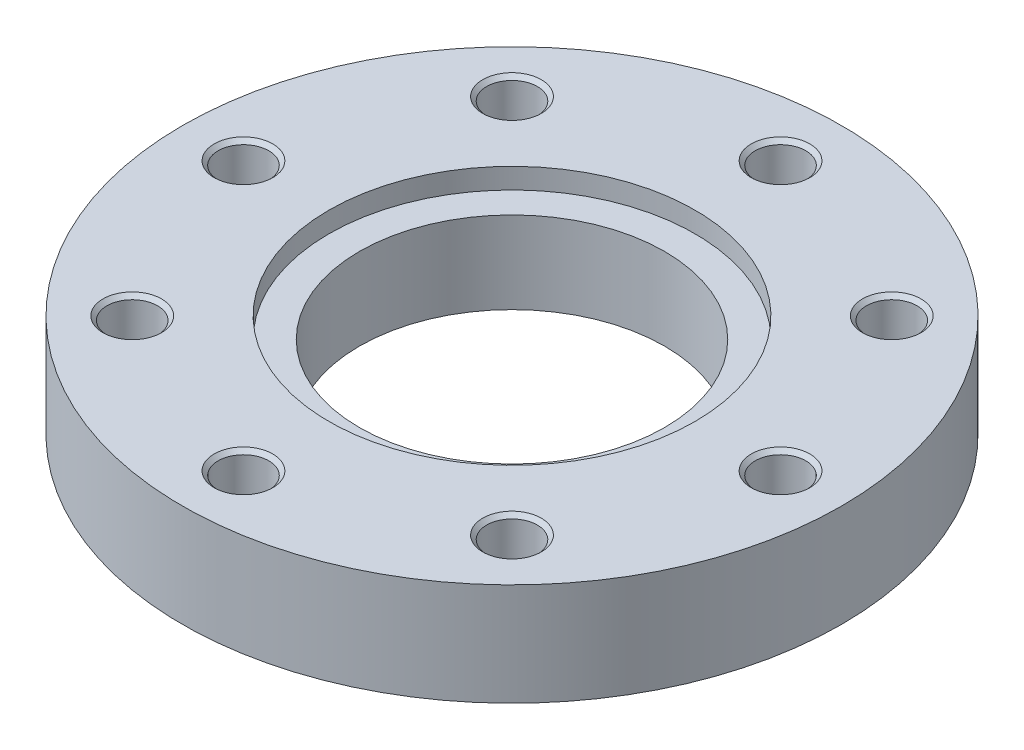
ISO-10303-21;
HEADER;
FILE_DESCRIPTION(('STEP AP214'),'2;1');
FILE_NAME('part.step','',(''),(''),'','','');
FILE_SCHEMA(('AUTOMOTIVE_DESIGN { 1 0 10303 214 1 1 1 1 }'));
ENDSEC;
DATA;
#1=APPLICATION_CONTEXT('core data for automotive mechanical design processes');
#2=APPLICATION_PROTOCOL_DEFINITION('international standard','automotive_design',2000,#1);
#3=PRODUCT_CONTEXT('',#1,'mechanical');
#4=PRODUCT('Part','Part','',(#3));
#5=PRODUCT_RELATED_PRODUCT_CATEGORY('part','',(#4));
#6=PRODUCT_DEFINITION_FORMATION('','',#4);
#7=PRODUCT_DEFINITION_CONTEXT('part definition',#1,'design');
#8=PRODUCT_DEFINITION('design','',#6,#7);
#9=PRODUCT_DEFINITION_SHAPE('','',#8);
#10=(LENGTH_UNIT() NAMED_UNIT(*) SI_UNIT(.MILLI.,.METRE.));
#11=(NAMED_UNIT(*) PLANE_ANGLE_UNIT() SI_UNIT($,.RADIAN.));
#12=(NAMED_UNIT(*) SI_UNIT($,.STERADIAN.) SOLID_ANGLE_UNIT());
#13=UNCERTAINTY_MEASURE_WITH_UNIT(LENGTH_MEASURE(1.E-05),#10,'distance_accuracy_value','');
#14=(GEOMETRIC_REPRESENTATION_CONTEXT(3) GLOBAL_UNCERTAINTY_ASSIGNED_CONTEXT((#13)) GLOBAL_UNIT_ASSIGNED_CONTEXT((#10,
#11,#12)) REPRESENTATION_CONTEXT('',''));
#15=CARTESIAN_POINT('',(0.,0.,0.));
#16=DIRECTION('',(0.,0.,1.));
#17=DIRECTION('',(1.,0.,0.));
#18=AXIS2_PLACEMENT_3D('',#15,#16,#17);
#19=CARTESIAN_POINT('',(0.,21.,0.));
#20=DIRECTION('',(0.,-1.,0.));
#21=DIRECTION('',(1.,0.,0.));
#22=AXIS2_PLACEMENT_3D('',#19,#20,#21);
#23=CYLINDRICAL_SURFACE('',#22,135.);
#24=CARTESIAN_POINT('',(0.,0.,0.));
#25=DIRECTION('',(0.,1.,0.));
#26=DIRECTION('',(1.,0.,0.));
#27=AXIS2_PLACEMENT_3D('',#24,#25,#26);
#28=CIRCLE('',#27,135.);
#29=CARTESIAN_POINT('',(135.,0.,0.));
#30=VERTEX_POINT('',#29);
#31=EDGE_CURVE('E9',#30,#30,#28,.T.);
#32=ORIENTED_EDGE('',*,*,#31,.T.);
#33=EDGE_LOOP('',(#32));
#34=FACE_BOUND('',#33,.T.);
#35=CARTESIAN_POINT('',(0.,42.,0.));
#36=DIRECTION('',(0.,1.,0.));
#37=DIRECTION('',(1.,0.,0.));
#38=AXIS2_PLACEMENT_3D('',#35,#36,#37);
#39=CIRCLE('',#38,135.);
#40=CARTESIAN_POINT('',(135.,42.,0.));
#41=VERTEX_POINT('',#40);
#42=EDGE_CURVE('E261',#41,#41,#39,.T.);
#43=ORIENTED_EDGE('',*,*,#42,.F.);
#44=EDGE_LOOP('',(#43));
#45=FACE_BOUND('',#44,.T.);
#46=ADVANCED_FACE('F15',(#34,#45),#23,.T.);
#47=CARTESIAN_POINT('',(98.75,0.,0.));
#48=DIRECTION('',(0.,-1.,0.));
#49=DIRECTION('',(-1.,0.,0.));
#50=AXIS2_PLACEMENT_3D('',#47,#48,#49);
#51=PLANE('',#50);
#52=CARTESIAN_POINT('',(0.,0.,0.));
#53=DIRECTION('',(0.,1.,0.));
#54=DIRECTION('',(1.,0.,0.));
#55=AXIS2_PLACEMENT_3D('',#52,#53,#54);
#56=CIRCLE('',#55,62.5);
#57=CARTESIAN_POINT('',(62.5,0.,0.));
#58=VERTEX_POINT('',#57);
#59=EDGE_CURVE('E22',#58,#58,#56,.T.);
#60=ORIENTED_EDGE('',*,*,#59,.T.);
#61=EDGE_LOOP('',(#60));
#62=FACE_BOUND('',#61,.T.);
#63=ORIENTED_EDGE('',*,*,#31,.F.);
#64=EDGE_LOOP('',(#63));
#65=FACE_BOUND('',#64,.T.);
#66=ADVANCED_FACE('F339',(#62,#65),#51,.T.);
#67=CARTESIAN_POINT('',(0.,21.,0.));
#68=DIRECTION('',(0.,-1.,0.));
#69=DIRECTION('',(1.,0.,0.));
#70=AXIS2_PLACEMENT_3D('',#67,#68,#69);
#71=CYLINDRICAL_SURFACE('',#70,62.5);
#72=ORIENTED_EDGE('',*,*,#59,.F.);
#73=EDGE_LOOP('',(#72));
#74=FACE_BOUND('',#73,.T.);
#75=CARTESIAN_POINT('',(0.,33.6,0.));
#76=DIRECTION('',(0.,1.,0.));
#77=DIRECTION('',(1.,0.,0.));
#78=AXIS2_PLACEMENT_3D('',#75,#76,#77);
#79=CIRCLE('',#78,62.5);
#80=CARTESIAN_POINT('',(-62.5,33.6,0.));
#81=VERTEX_POINT('',#80);
#82=EDGE_CURVE('E263',#81,#81,#79,.T.);
#83=ORIENTED_EDGE('',*,*,#82,.T.);
#84=EDGE_LOOP('',(#83));
#85=FACE_BOUND('',#84,.T.);
#86=ADVANCED_FACE('F320',(#74,#85),#71,.F.);
#87=CARTESIAN_POINT('',(98.75,42.,0.));
#88=DIRECTION('',(0.,1.,0.));
#89=DIRECTION('',(1.,0.,0.));
#90=AXIS2_PLACEMENT_3D('',#87,#88,#89);
#91=PLANE('',#90);
#92=ORIENTED_EDGE('',*,*,#42,.T.);
#93=EDGE_LOOP('',(#92));
#94=FACE_BOUND('',#93,.T.);
#95=CARTESIAN_POINT('',(0.,42.,0.));
#96=DIRECTION('',(0.,-1.,0.));
#97=DIRECTION('',(1.,0.,0.));
#98=AXIS2_PLACEMENT_3D('',#95,#96,#97);
#99=CIRCLE('',#98,75.);
#100=CARTESIAN_POINT('',(-75.,42.,0.));
#101=VERTEX_POINT('',#100);
#102=EDGE_CURVE('E269',#101,#101,#99,.T.);
#103=ORIENTED_EDGE('',*,*,#102,.T.);
#104=EDGE_LOOP('',(#103));
#105=FACE_BOUND('',#104,.T.);
#106=CARTESIAN_POINT('',(110.,42.,0.));
#107=DIRECTION('',(0.,-1.,0.));
#108=DIRECTION('',(1.,0.,0.));
#109=AXIS2_PLACEMENT_3D('',#106,#107,#108);
#110=CIRCLE('',#109,12.);
#111=CARTESIAN_POINT('',(122.,42.,0.));
#112=VERTEX_POINT('',#111);
#113=EDGE_CURVE('E309',#112,#112,#110,.T.);
#114=ORIENTED_EDGE('',*,*,#113,.T.);
#115=EDGE_LOOP('',(#114));
#116=FACE_BOUND('',#115,.T.);
#117=CARTESIAN_POINT('',(77.7817459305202,42.,-77.7817459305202));
#118=DIRECTION('',(0.,-1.,0.));
#119=DIRECTION('',(0.707106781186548,0.,-0.707106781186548));
#120=AXIS2_PLACEMENT_3D('',#117,#118,#119);
#121=CIRCLE('',#120,12.);
#122=CARTESIAN_POINT('',(86.2670273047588,42.,-86.2670273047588));
#123=VERTEX_POINT('',#122);
#124=EDGE_CURVE('E227',#123,#123,#121,.T.);
#125=ORIENTED_EDGE('',*,*,#124,.T.);
#126=EDGE_LOOP('',(#125));
#127=FACE_BOUND('',#126,.T.);
#128=CARTESIAN_POINT('',(0.,42.,-110.));
#129=DIRECTION('',(0.,-1.,0.));
#130=DIRECTION('',(0.,0.,-1.));
#131=AXIS2_PLACEMENT_3D('',#128,#129,#130);
#132=CIRCLE('',#131,12.);
#133=CARTESIAN_POINT('',(0.,42.,-122.));
#134=VERTEX_POINT('',#133);
#135=EDGE_CURVE('E291',#134,#134,#132,.T.);
#136=ORIENTED_EDGE('',*,*,#135,.T.);
#137=EDGE_LOOP('',(#136));
#138=FACE_BOUND('',#137,.T.);
#139=CARTESIAN_POINT('',(-77.7817459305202,42.,-77.7817459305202));
#140=DIRECTION('',(0.,-1.,0.));
#141=DIRECTION('',(-0.707106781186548,0.,-0.707106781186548));
#142=AXIS2_PLACEMENT_3D('',#139,#140,#141);
#143=CIRCLE('',#142,12.);
#144=CARTESIAN_POINT('',(-86.2670273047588,42.,-86.2670273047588));
#145=VERTEX_POINT('',#144);
#146=EDGE_CURVE('E283',#145,#145,#143,.T.);
#147=ORIENTED_EDGE('',*,*,#146,.T.);
#148=EDGE_LOOP('',(#147));
#149=FACE_BOUND('',#148,.T.);
#150=CARTESIAN_POINT('',(-110.,42.,0.));
#151=DIRECTION('',(0.,-1.,0.));
#152=DIRECTION('',(-1.,0.,0.));
#153=AXIS2_PLACEMENT_3D('',#150,#151,#152);
#154=CIRCLE('',#153,12.);
#155=CARTESIAN_POINT('',(-122.,42.,0.));
#156=VERTEX_POINT('',#155);
#157=EDGE_CURVE('E274',#156,#156,#154,.T.);
#158=ORIENTED_EDGE('',*,*,#157,.T.);
#159=EDGE_LOOP('',(#158));
#160=FACE_BOUND('',#159,.T.);
#161=CARTESIAN_POINT('',(-77.7817459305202,42.,77.7817459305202));
#162=DIRECTION('',(0.,-1.,0.));
#163=DIRECTION('',(-0.707106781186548,0.,0.707106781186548));
#164=AXIS2_PLACEMENT_3D('',#161,#162,#163);
#165=CIRCLE('',#164,12.);
#166=CARTESIAN_POINT('',(-86.2670273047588,42.,86.2670273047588));
#167=VERTEX_POINT('',#166);
#168=EDGE_CURVE('E236',#167,#167,#165,.T.);
#169=ORIENTED_EDGE('',*,*,#168,.T.);
#170=EDGE_LOOP('',(#169));
#171=FACE_BOUND('',#170,.T.);
#172=CARTESIAN_POINT('',(0.,42.,110.));
#173=DIRECTION('',(0.,-1.,0.));
#174=DIRECTION('',(0.,0.,1.));
#175=AXIS2_PLACEMENT_3D('',#172,#173,#174);
#176=CIRCLE('',#175,12.);
#177=CARTESIAN_POINT('',(0.,42.,122.));
#178=VERTEX_POINT('',#177);
#179=EDGE_CURVE('E211',#178,#178,#176,.T.);
#180=ORIENTED_EDGE('',*,*,#179,.T.);
#181=EDGE_LOOP('',(#180));
#182=FACE_BOUND('',#181,.T.);
#183=CARTESIAN_POINT('',(77.7817459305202,42.,77.7817459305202));
#184=DIRECTION('',(0.,-1.,0.));
#185=DIRECTION('',(0.707106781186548,0.,0.707106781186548));
#186=AXIS2_PLACEMENT_3D('',#183,#184,#185);
#187=CIRCLE('',#186,12.);
#188=CARTESIAN_POINT('',(86.2670273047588,42.,86.2670273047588));
#189=VERTEX_POINT('',#188);
#190=EDGE_CURVE('E233',#189,#189,#187,.T.);
#191=ORIENTED_EDGE('',*,*,#190,.T.);
#192=EDGE_LOOP('',(#191));
#193=FACE_BOUND('',#192,.T.);
#194=ADVANCED_FACE('F212',(#94,#105,#116,#127,#138,#149,#160,#171,#182,#193),#91,.T.);
#195=CARTESIAN_POINT('',(0.,33.6,0.));
#196=DIRECTION('',(0.,-1.,0.));
#197=DIRECTION('',(-1.,0.,0.));
#198=AXIS2_PLACEMENT_3D('',#195,#196,#197);
#199=PLANE('',#198);
#200=CARTESIAN_POINT('',(0.,33.6,0.));
#201=DIRECTION('',(0.,-1.,0.));
#202=DIRECTION('',(1.,0.,0.));
#203=AXIS2_PLACEMENT_3D('',#200,#201,#202);
#204=CIRCLE('',#203,75.);
#205=CARTESIAN_POINT('',(75.,33.6,0.));
#206=VERTEX_POINT('',#205);
#207=EDGE_CURVE('E271',#206,#206,#204,.T.);
#208=ORIENTED_EDGE('',*,*,#207,.F.);
#209=EDGE_LOOP('',(#208));
#210=FACE_BOUND('',#209,.T.);
#211=ORIENTED_EDGE('',*,*,#82,.F.);
#212=EDGE_LOOP('',(#211));
#213=FACE_BOUND('',#212,.T.);
#214=ADVANCED_FACE('F322',(#210,#213),#199,.F.);
#215=CARTESIAN_POINT('',(0.,39.9,0.));
#216=DIRECTION('',(0.,-1.,0.));
#217=DIRECTION('',(1.,0.,0.));
#218=AXIS2_PLACEMENT_3D('',#215,#216,#217);
#219=CYLINDRICAL_SURFACE('',#218,75.);
#220=ORIENTED_EDGE('',*,*,#207,.T.);
#221=EDGE_LOOP('',(#220));
#222=FACE_BOUND('',#221,.T.);
#223=ORIENTED_EDGE('',*,*,#102,.F.);
#224=EDGE_LOOP('',(#223));
#225=FACE_BOUND('',#224,.T.);
#226=ADVANCED_FACE('F324',(#222,#225),#219,.F.);
#227=CARTESIAN_POINT('',(110.,6.00463463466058,0.));
#228=DIRECTION('',(0.,1.,0.));
#229=DIRECTION('',(1.,0.,0.));
#230=AXIS2_PLACEMENT_3D('',#227,#228,#229);
#231=CONICAL_SURFACE('',#230,5.188125,1.0471975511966);
#232=CARTESIAN_POINT('',(110.,9.,0.));
#233=DIRECTION('',(0.,-1.,0.));
#234=DIRECTION('',(1.,0.,0.));
#235=AXIS2_PLACEMENT_3D('',#232,#233,#234);
#236=CIRCLE('',#235,10.37625);
#237=CARTESIAN_POINT('',(120.37625,9.,0.));
#238=VERTEX_POINT('',#237);
#239=EDGE_CURVE('E272',#238,#238,#236,.T.);
#240=ORIENTED_EDGE('',*,*,#239,.F.);
#241=EDGE_LOOP('',(#240));
#242=FACE_BOUND('',#241,.T.);
#243=CARTESIAN_POINT('',(110.,3.00926926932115,0.));
#244=VERTEX_POINT('',#243);
#245=VERTEX_LOOP('',#244);
#246=FACE_BOUND('',#245,.T.);
#247=ADVANCED_FACE('F332',(#242,#246),#231,.F.);
#248=CARTESIAN_POINT('',(110.,12.688125,0.));
#249=DIRECTION('',(0.,1.,0.));
#250=DIRECTION('',(1.,0.,0.));
#251=AXIS2_PLACEMENT_3D('',#248,#249,#250);
#252=CYLINDRICAL_SURFACE('',#251,10.37625);
#253=CARTESIAN_POINT('',(110.,16.37625,0.));
#254=DIRECTION('',(0.,-1.,0.));
#255=DIRECTION('',(1.,0.,0.));
#256=AXIS2_PLACEMENT_3D('',#253,#254,#255);
#257=CIRCLE('',#256,10.37625);
#258=CARTESIAN_POINT('',(120.37625,16.37625,0.));
#259=VERTEX_POINT('',#258);
#260=EDGE_CURVE('E315',#259,#259,#257,.T.);
#261=ORIENTED_EDGE('',*,*,#260,.F.);
#262=EDGE_LOOP('',(#261));
#263=FACE_BOUND('',#262,.T.);
#264=ORIENTED_EDGE('',*,*,#239,.T.);
#265=EDGE_LOOP('',(#264));
#266=FACE_BOUND('',#265,.T.);
#267=ADVANCED_FACE('F505',(#263,#266),#252,.F.);
#268=CARTESIAN_POINT('',(110.,17.188125,0.));
#269=DIRECTION('',(0.,1.,0.));
#270=DIRECTION('',(1.,0.,0.));
#271=AXIS2_PLACEMENT_3D('',#268,#269,#270);
#272=CONICAL_SURFACE('',#271,11.188125,0.785398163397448);
#273=CARTESIAN_POINT('',(110.,18.,0.));
#274=DIRECTION('',(0.,-1.,0.));
#275=DIRECTION('',(1.,0.,0.));
#276=AXIS2_PLACEMENT_3D('',#273,#274,#275);
#277=CIRCLE('',#276,12.);
#278=CARTESIAN_POINT('',(122.,18.,0.));
#279=VERTEX_POINT('',#278);
#280=EDGE_CURVE('E313',#279,#279,#277,.T.);
#281=ORIENTED_EDGE('',*,*,#280,.F.);
#282=EDGE_LOOP('',(#281));
#283=FACE_BOUND('',#282,.T.);
#284=ORIENTED_EDGE('',*,*,#260,.T.);
#285=EDGE_LOOP('',(#284));
#286=FACE_BOUND('',#285,.T.);
#287=ADVANCED_FACE('F501',(#283,#286),#272,.F.);
#288=CARTESIAN_POINT('',(121.188125,18.,0.));
#289=DIRECTION('',(0.,1.,0.));
#290=DIRECTION('',(-1.,0.,0.));
#291=AXIS2_PLACEMENT_3D('',#288,#289,#290);
#292=PLANE('',#291);
#293=CARTESIAN_POINT('',(110.,18.,0.));
#294=DIRECTION('',(0.,-1.,0.));
#295=DIRECTION('',(1.,0.,0.));
#296=AXIS2_PLACEMENT_3D('',#293,#294,#295);
#297=CIRCLE('',#296,10.37625);
#298=CARTESIAN_POINT('',(120.37625,18.,0.));
#299=VERTEX_POINT('',#298);
#300=EDGE_CURVE('E311',#299,#299,#297,.T.);
#301=ORIENTED_EDGE('',*,*,#300,.F.);
#302=EDGE_LOOP('',(#301));
#303=FACE_BOUND('',#302,.T.);
#304=ORIENTED_EDGE('',*,*,#280,.T.);
#305=EDGE_LOOP('',(#304));
#306=FACE_BOUND('',#305,.T.);
#307=ADVANCED_FACE('F497',(#303,#306),#292,.F.);
#308=CARTESIAN_POINT('',(110.,29.188125,0.));
#309=DIRECTION('',(0.,1.,0.));
#310=DIRECTION('',(1.,0.,0.));
#311=AXIS2_PLACEMENT_3D('',#308,#309,#310);
#312=CYLINDRICAL_SURFACE('',#311,10.37625);
#313=CARTESIAN_POINT('',(110.,40.37625,0.));
#314=DIRECTION('',(0.,-1.,0.));
#315=DIRECTION('',(1.,0.,0.));
#316=AXIS2_PLACEMENT_3D('',#313,#314,#315);
#317=CIRCLE('',#316,10.37625);
#318=CARTESIAN_POINT('',(120.37625,40.37625,0.));
#319=VERTEX_POINT('',#318);
#320=EDGE_CURVE('E307',#319,#319,#317,.T.);
#321=ORIENTED_EDGE('',*,*,#320,.F.);
#322=EDGE_LOOP('',(#321));
#323=FACE_BOUND('',#322,.T.);
#324=ORIENTED_EDGE('',*,*,#300,.T.);
#325=EDGE_LOOP('',(#324));
#326=FACE_BOUND('',#325,.T.);
#327=ADVANCED_FACE('F493',(#323,#326),#312,.F.);
#328=CARTESIAN_POINT('',(110.,41.188125,0.));
#329=DIRECTION('',(0.,1.,0.));
#330=DIRECTION('',(1.,0.,0.));
#331=AXIS2_PLACEMENT_3D('',#328,#329,#330);
#332=CONICAL_SURFACE('',#331,11.188125,0.785398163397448);
#333=ORIENTED_EDGE('',*,*,#113,.F.);
#334=EDGE_LOOP('',(#333));
#335=FACE_BOUND('',#334,.T.);
#336=ORIENTED_EDGE('',*,*,#320,.T.);
#337=EDGE_LOOP('',(#336));
#338=FACE_BOUND('',#337,.T.);
#339=ADVANCED_FACE('F489',(#335,#338),#332,.F.);
#340=CARTESIAN_POINT('',(77.7817459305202,6.00463463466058,-77.7817459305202));
#341=DIRECTION('',(0.,1.,0.));
#342=DIRECTION('',(0.707106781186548,0.,-0.707106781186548));
#343=AXIS2_PLACEMENT_3D('',#340,#341,#342);
#344=CONICAL_SURFACE('',#343,5.188125,1.0471975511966);
#345=CARTESIAN_POINT('',(77.7817459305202,9.,-77.7817459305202));
#346=DIRECTION('',(0.,-1.,0.));
#347=DIRECTION('',(0.707106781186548,0.,-0.707106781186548));
#348=AXIS2_PLACEMENT_3D('',#345,#346,#347);
#349=CIRCLE('',#348,10.37625);
#350=CARTESIAN_POINT('',(85.1188626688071,9.,-85.1188626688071));
#351=VERTEX_POINT('',#350);
#352=EDGE_CURVE('E305',#351,#351,#349,.T.);
#353=ORIENTED_EDGE('',*,*,#352,.F.);
#354=EDGE_LOOP('',(#353));
#355=FACE_BOUND('',#354,.T.);
#356=CARTESIAN_POINT('',(77.7817459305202,3.00926926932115,-77.7817459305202));
#357=VERTEX_POINT('',#356);
#358=VERTEX_LOOP('',#357);
#359=FACE_BOUND('',#358,.T.);
#360=ADVANCED_FACE('F485',(#355,#359),#344,.F.);
#361=CARTESIAN_POINT('',(77.7817459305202,12.688125,-77.7817459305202));
#362=DIRECTION('',(0.,1.,0.));
#363=DIRECTION('',(0.707106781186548,0.,-0.707106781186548));
#364=AXIS2_PLACEMENT_3D('',#361,#362,#363);
#365=CYLINDRICAL_SURFACE('',#364,10.37625);
#366=CARTESIAN_POINT('',(77.7817459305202,16.37625,-77.7817459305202));
#367=DIRECTION('',(0.,-1.,0.));
#368=DIRECTION('',(0.707106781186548,0.,-0.707106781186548));
#369=AXIS2_PLACEMENT_3D('',#366,#367,#368);
#370=CIRCLE('',#369,10.37625);
#371=CARTESIAN_POINT('',(85.1188626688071,16.37625,-85.1188626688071));
#372=VERTEX_POINT('',#371);
#373=EDGE_CURVE('E303',#372,#372,#370,.T.);
#374=ORIENTED_EDGE('',*,*,#373,.F.);
#375=EDGE_LOOP('',(#374));
#376=FACE_BOUND('',#375,.T.);
#377=ORIENTED_EDGE('',*,*,#352,.T.);
#378=EDGE_LOOP('',(#377));
#379=FACE_BOUND('',#378,.T.);
#380=ADVANCED_FACE('F481',(#376,#379),#365,.F.);
#381=CARTESIAN_POINT('',(77.7817459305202,17.188125,-77.7817459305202));
#382=DIRECTION('',(0.,1.,0.));
#383=DIRECTION('',(0.707106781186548,0.,-0.707106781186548));
#384=AXIS2_PLACEMENT_3D('',#381,#382,#383);
#385=CONICAL_SURFACE('',#384,11.188125,0.785398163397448);
#386=CARTESIAN_POINT('',(77.7817459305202,18.,-77.7817459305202));
#387=DIRECTION('',(0.,-1.,0.));
#388=DIRECTION('',(0.707106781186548,0.,-0.707106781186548));
#389=AXIS2_PLACEMENT_3D('',#386,#387,#388);
#390=CIRCLE('',#389,12.);
#391=CARTESIAN_POINT('',(86.2670273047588,18.,-86.2670273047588));
#392=VERTEX_POINT('',#391);
#393=EDGE_CURVE('E301',#392,#392,#390,.T.);
#394=ORIENTED_EDGE('',*,*,#393,.F.);
#395=EDGE_LOOP('',(#394));
#396=FACE_BOUND('',#395,.T.);
#397=ORIENTED_EDGE('',*,*,#373,.T.);
#398=EDGE_LOOP('',(#397));
#399=FACE_BOUND('',#398,.T.);
#400=ADVANCED_FACE('F477',(#396,#399),#385,.F.);
#401=CARTESIAN_POINT('',(85.692944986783,18.,-85.692944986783));
#402=DIRECTION('',(0.,1.,0.));
#403=DIRECTION('',(-0.707106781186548,0.,0.707106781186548));
#404=AXIS2_PLACEMENT_3D('',#401,#402,#403);
#405=PLANE('',#404);
#406=CARTESIAN_POINT('',(77.7817459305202,18.,-77.7817459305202));
#407=DIRECTION('',(0.,-1.,0.));
#408=DIRECTION('',(0.707106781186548,0.,-0.707106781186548));
#409=AXIS2_PLACEMENT_3D('',#406,#407,#408);
#410=CIRCLE('',#409,10.37625);
#411=CARTESIAN_POINT('',(85.1188626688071,18.,-85.1188626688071));
#412=VERTEX_POINT('',#411);
#413=EDGE_CURVE('E229',#412,#412,#410,.T.);
#414=ORIENTED_EDGE('',*,*,#413,.F.);
#415=EDGE_LOOP('',(#414));
#416=FACE_BOUND('',#415,.T.);
#417=ORIENTED_EDGE('',*,*,#393,.T.);
#418=EDGE_LOOP('',(#417));
#419=FACE_BOUND('',#418,.T.);
#420=ADVANCED_FACE('F473',(#416,#419),#405,.F.);
#421=CARTESIAN_POINT('',(77.7817459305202,29.188125,-77.7817459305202));
#422=DIRECTION('',(0.,1.,0.));
#423=DIRECTION('',(0.707106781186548,0.,-0.707106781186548));
#424=AXIS2_PLACEMENT_3D('',#421,#422,#423);
#425=CYLINDRICAL_SURFACE('',#424,10.37625);
#426=CARTESIAN_POINT('',(77.7817459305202,40.37625,-77.7817459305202));
#427=DIRECTION('',(0.,-1.,0.));
#428=DIRECTION('',(0.707106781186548,0.,-0.707106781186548));
#429=AXIS2_PLACEMENT_3D('',#426,#427,#428);
#430=CIRCLE('',#429,10.37625);
#431=CARTESIAN_POINT('',(85.1188626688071,40.37625,-85.1188626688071));
#432=VERTEX_POINT('',#431);
#433=EDGE_CURVE('E230',#432,#432,#430,.T.);
#434=ORIENTED_EDGE('',*,*,#433,.F.);
#435=EDGE_LOOP('',(#434));
#436=FACE_BOUND('',#435,.T.);
#437=ORIENTED_EDGE('',*,*,#413,.T.);
#438=EDGE_LOOP('',(#437));
#439=FACE_BOUND('',#438,.T.);
#440=ADVANCED_FACE('F469',(#436,#439),#425,.F.);
#441=CARTESIAN_POINT('',(77.7817459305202,41.188125,-77.7817459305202));
#442=DIRECTION('',(0.,1.,0.));
#443=DIRECTION('',(0.707106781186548,0.,-0.707106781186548));
#444=AXIS2_PLACEMENT_3D('',#441,#442,#443);
#445=CONICAL_SURFACE('',#444,11.188125,0.785398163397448);
#446=ORIENTED_EDGE('',*,*,#124,.F.);
#447=EDGE_LOOP('',(#446));
#448=FACE_BOUND('',#447,.T.);
#449=ORIENTED_EDGE('',*,*,#433,.T.);
#450=EDGE_LOOP('',(#449));
#451=FACE_BOUND('',#450,.T.);
#452=ADVANCED_FACE('F465',(#448,#451),#445,.F.);
#453=CARTESIAN_POINT('',(0.,6.00463463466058,-110.));
#454=DIRECTION('',(0.,1.,0.));
#455=DIRECTION('',(0.,0.,-1.));
#456=AXIS2_PLACEMENT_3D('',#453,#454,#455);
#457=CONICAL_SURFACE('',#456,5.188125,1.0471975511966);
#458=CARTESIAN_POINT('',(0.,9.,-110.));
#459=DIRECTION('',(0.,-1.,0.));
#460=DIRECTION('',(0.,0.,-1.));
#461=AXIS2_PLACEMENT_3D('',#458,#459,#460);
#462=CIRCLE('',#461,10.37625);
#463=CARTESIAN_POINT('',(0.,9.,-120.37625));
#464=VERTEX_POINT('',#463);
#465=EDGE_CURVE('E224',#464,#464,#462,.T.);
#466=ORIENTED_EDGE('',*,*,#465,.F.);
#467=EDGE_LOOP('',(#466));
#468=FACE_BOUND('',#467,.T.);
#469=CARTESIAN_POINT('',(0.,3.00926926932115,-110.));
#470=VERTEX_POINT('',#469);
#471=VERTEX_LOOP('',#470);
#472=FACE_BOUND('',#471,.T.);
#473=ADVANCED_FACE('F461',(#468,#472),#457,.F.);
#474=CARTESIAN_POINT('',(0.,12.688125,-110.));
#475=DIRECTION('',(0.,1.,0.));
#476=DIRECTION('',(0.,0.,-1.));
#477=AXIS2_PLACEMENT_3D('',#474,#475,#476);
#478=CYLINDRICAL_SURFACE('',#477,10.37625);
#479=CARTESIAN_POINT('',(0.,16.37625,-110.));
#480=DIRECTION('',(0.,-1.,0.));
#481=DIRECTION('',(0.,0.,-1.));
#482=AXIS2_PLACEMENT_3D('',#479,#480,#481);
#483=CIRCLE('',#482,10.37625);
#484=CARTESIAN_POINT('',(0.,16.37625,-120.37625));
#485=VERTEX_POINT('',#484);
#486=EDGE_CURVE('E297',#485,#485,#483,.T.);
#487=ORIENTED_EDGE('',*,*,#486,.F.);
#488=EDGE_LOOP('',(#487));
#489=FACE_BOUND('',#488,.T.);
#490=ORIENTED_EDGE('',*,*,#465,.T.);
#491=EDGE_LOOP('',(#490));
#492=FACE_BOUND('',#491,.T.);
#493=ADVANCED_FACE('F457',(#489,#492),#478,.F.);
#494=CARTESIAN_POINT('',(0.,17.188125,-110.));
#495=DIRECTION('',(0.,1.,0.));
#496=DIRECTION('',(0.,0.,-1.));
#497=AXIS2_PLACEMENT_3D('',#494,#495,#496);
#498=CONICAL_SURFACE('',#497,11.188125,0.785398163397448);
#499=CARTESIAN_POINT('',(0.,18.,-110.));
#500=DIRECTION('',(0.,-1.,0.));
#501=DIRECTION('',(0.,0.,-1.));
#502=AXIS2_PLACEMENT_3D('',#499,#500,#501);
#503=CIRCLE('',#502,12.);
#504=CARTESIAN_POINT('',(0.,18.,-122.));
#505=VERTEX_POINT('',#504);
#506=EDGE_CURVE('E295',#505,#505,#503,.T.);
#507=ORIENTED_EDGE('',*,*,#506,.F.);
#508=EDGE_LOOP('',(#507));
#509=FACE_BOUND('',#508,.T.);
#510=ORIENTED_EDGE('',*,*,#486,.T.);
#511=EDGE_LOOP('',(#510));
#512=FACE_BOUND('',#511,.T.);
#513=ADVANCED_FACE('F453',(#509,#512),#498,.F.);
#514=CARTESIAN_POINT('',(0.,18.,-121.188125));
#515=DIRECTION('',(0.,1.,0.));
#516=DIRECTION('',(0.,0.,1.));
#517=AXIS2_PLACEMENT_3D('',#514,#515,#516);
#518=PLANE('',#517);
#519=CARTESIAN_POINT('',(0.,18.,-110.));
#520=DIRECTION('',(0.,-1.,0.));
#521=DIRECTION('',(0.,0.,-1.));
#522=AXIS2_PLACEMENT_3D('',#519,#520,#521);
#523=CIRCLE('',#522,10.37625);
#524=CARTESIAN_POINT('',(0.,18.,-120.37625));
#525=VERTEX_POINT('',#524);
#526=EDGE_CURVE('E293',#525,#525,#523,.T.);
#527=ORIENTED_EDGE('',*,*,#526,.F.);
#528=EDGE_LOOP('',(#527));
#529=FACE_BOUND('',#528,.T.);
#530=ORIENTED_EDGE('',*,*,#506,.T.);
#531=EDGE_LOOP('',(#530));
#532=FACE_BOUND('',#531,.T.);
#533=ADVANCED_FACE('F449',(#529,#532),#518,.F.);
#534=CARTESIAN_POINT('',(0.,29.188125,-110.));
#535=DIRECTION('',(0.,1.,0.));
#536=DIRECTION('',(0.,0.,-1.));
#537=AXIS2_PLACEMENT_3D('',#534,#535,#536);
#538=CYLINDRICAL_SURFACE('',#537,10.37625);
#539=CARTESIAN_POINT('',(0.,40.37625,-110.));
#540=DIRECTION('',(0.,-1.,0.));
#541=DIRECTION('',(0.,0.,-1.));
#542=AXIS2_PLACEMENT_3D('',#539,#540,#541);
#543=CIRCLE('',#542,10.37625);
#544=CARTESIAN_POINT('',(0.,40.37625,-120.37625));
#545=VERTEX_POINT('',#544);
#546=EDGE_CURVE('E289',#545,#545,#543,.T.);
#547=ORIENTED_EDGE('',*,*,#546,.F.);
#548=EDGE_LOOP('',(#547));
#549=FACE_BOUND('',#548,.T.);
#550=ORIENTED_EDGE('',*,*,#526,.T.);
#551=EDGE_LOOP('',(#550));
#552=FACE_BOUND('',#551,.T.);
#553=ADVANCED_FACE('F445',(#549,#552),#538,.F.);
#554=CARTESIAN_POINT('',(0.,41.188125,-110.));
#555=DIRECTION('',(0.,1.,0.));
#556=DIRECTION('',(0.,0.,-1.));
#557=AXIS2_PLACEMENT_3D('',#554,#555,#556);
#558=CONICAL_SURFACE('',#557,11.188125,0.785398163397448);
#559=ORIENTED_EDGE('',*,*,#135,.F.);
#560=EDGE_LOOP('',(#559));
#561=FACE_BOUND('',#560,.T.);
#562=ORIENTED_EDGE('',*,*,#546,.T.);
#563=EDGE_LOOP('',(#562));
#564=FACE_BOUND('',#563,.T.);
#565=ADVANCED_FACE('F441',(#561,#564),#558,.F.);
#566=CARTESIAN_POINT('',(-77.7817459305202,6.00463463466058,-77.7817459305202));
#567=DIRECTION('',(0.,1.,0.));
#568=DIRECTION('',(-0.707106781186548,0.,-0.707106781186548));
#569=AXIS2_PLACEMENT_3D('',#566,#567,#568);
#570=CONICAL_SURFACE('',#569,5.188125,1.0471975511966);
#571=CARTESIAN_POINT('',(-77.7817459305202,9.,-77.7817459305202));
#572=DIRECTION('',(0.,-1.,0.));
#573=DIRECTION('',(-0.707106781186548,0.,-0.707106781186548));
#574=AXIS2_PLACEMENT_3D('',#571,#572,#573);
#575=CIRCLE('',#574,10.37625);
#576=CARTESIAN_POINT('',(-85.1188626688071,9.,-85.1188626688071));
#577=VERTEX_POINT('',#576);
#578=EDGE_CURVE('E258',#577,#577,#575,.T.);
#579=ORIENTED_EDGE('',*,*,#578,.F.);
#580=EDGE_LOOP('',(#579));
#581=FACE_BOUND('',#580,.T.);
#582=CARTESIAN_POINT('',(-77.7817459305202,3.00926926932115,-77.7817459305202));
#583=VERTEX_POINT('',#582);
#584=VERTEX_LOOP('',#583);
#585=FACE_BOUND('',#584,.T.);
#586=ADVANCED_FACE('F437',(#581,#585),#570,.F.);
#587=CARTESIAN_POINT('',(-77.7817459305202,12.688125,-77.7817459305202));
#588=DIRECTION('',(0.,1.,0.));
#589=DIRECTION('',(-0.707106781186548,0.,-0.707106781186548));
#590=AXIS2_PLACEMENT_3D('',#587,#588,#589);
#591=CYLINDRICAL_SURFACE('',#590,10.37625);
#592=CARTESIAN_POINT('',(-77.7817459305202,16.37625,-77.7817459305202));
#593=DIRECTION('',(0.,-1.,0.));
#594=DIRECTION('',(-0.707106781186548,0.,-0.707106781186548));
#595=AXIS2_PLACEMENT_3D('',#592,#593,#594);
#596=CIRCLE('',#595,10.37625);
#597=CARTESIAN_POINT('',(-85.1188626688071,16.37625,-85.1188626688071));
#598=VERTEX_POINT('',#597);
#599=EDGE_CURVE('E257',#598,#598,#596,.T.);
#600=ORIENTED_EDGE('',*,*,#599,.F.);
#601=EDGE_LOOP('',(#600));
#602=FACE_BOUND('',#601,.T.);
#603=ORIENTED_EDGE('',*,*,#578,.T.);
#604=EDGE_LOOP('',(#603));
#605=FACE_BOUND('',#604,.T.);
#606=ADVANCED_FACE('F434',(#602,#605),#591,.F.);
#607=CARTESIAN_POINT('',(-77.7817459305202,17.188125,-77.7817459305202));
#608=DIRECTION('',(0.,1.,0.));
#609=DIRECTION('',(-0.707106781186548,0.,-0.707106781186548));
#610=AXIS2_PLACEMENT_3D('',#607,#608,#609);
#611=CONICAL_SURFACE('',#610,11.188125,0.785398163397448);
#612=CARTESIAN_POINT('',(-77.7817459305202,18.,-77.7817459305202));
#613=DIRECTION('',(0.,-1.,0.));
#614=DIRECTION('',(-0.707106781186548,0.,-0.707106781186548));
#615=AXIS2_PLACEMENT_3D('',#612,#613,#614);
#616=CIRCLE('',#615,12.);
#617=CARTESIAN_POINT('',(-86.2670273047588,18.,-86.2670273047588));
#618=VERTEX_POINT('',#617);
#619=EDGE_CURVE('E259',#618,#618,#616,.T.);
#620=ORIENTED_EDGE('',*,*,#619,.F.);
#621=EDGE_LOOP('',(#620));
#622=FACE_BOUND('',#621,.T.);
#623=ORIENTED_EDGE('',*,*,#599,.T.);
#624=EDGE_LOOP('',(#623));
#625=FACE_BOUND('',#624,.T.);
#626=ADVANCED_FACE('F432',(#622,#625),#611,.F.);
#627=CARTESIAN_POINT('',(-85.692944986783,18.,-85.692944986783));
#628=DIRECTION('',(0.,1.,0.));
#629=DIRECTION('',(0.707106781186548,0.,0.707106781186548));
#630=AXIS2_PLACEMENT_3D('',#627,#628,#629);
#631=PLANE('',#630);
#632=CARTESIAN_POINT('',(-77.7817459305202,18.,-77.7817459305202));
#633=DIRECTION('',(0.,-1.,0.));
#634=DIRECTION('',(-0.707106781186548,0.,-0.707106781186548));
#635=AXIS2_PLACEMENT_3D('',#632,#633,#634);
#636=CIRCLE('',#635,10.37625);
#637=CARTESIAN_POINT('',(-85.1188626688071,18.,-85.1188626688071));
#638=VERTEX_POINT('',#637);
#639=EDGE_CURVE('E285',#638,#638,#636,.T.);
#640=ORIENTED_EDGE('',*,*,#639,.F.);
#641=EDGE_LOOP('',(#640));
#642=FACE_BOUND('',#641,.T.);
#643=ORIENTED_EDGE('',*,*,#619,.T.);
#644=EDGE_LOOP('',(#643));
#645=FACE_BOUND('',#644,.T.);
#646=ADVANCED_FACE('F428',(#642,#645),#631,.F.);
#647=CARTESIAN_POINT('',(-77.7817459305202,29.188125,-77.7817459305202));
#648=DIRECTION('',(0.,1.,0.));
#649=DIRECTION('',(-0.707106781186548,0.,-0.707106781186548));
#650=AXIS2_PLACEMENT_3D('',#647,#648,#649);
#651=CYLINDRICAL_SURFACE('',#650,10.37625);
#652=CARTESIAN_POINT('',(-77.7817459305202,40.37625,-77.7817459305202));
#653=DIRECTION('',(0.,-1.,0.));
#654=DIRECTION('',(-0.707106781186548,0.,-0.707106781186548));
#655=AXIS2_PLACEMENT_3D('',#652,#653,#654);
#656=CIRCLE('',#655,10.37625);
#657=CARTESIAN_POINT('',(-85.1188626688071,40.37625,-85.1188626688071));
#658=VERTEX_POINT('',#657);
#659=EDGE_CURVE('E281',#658,#658,#656,.T.);
#660=ORIENTED_EDGE('',*,*,#659,.F.);
#661=EDGE_LOOP('',(#660));
#662=FACE_BOUND('',#661,.T.);
#663=ORIENTED_EDGE('',*,*,#639,.T.);
#664=EDGE_LOOP('',(#663));
#665=FACE_BOUND('',#664,.T.);
#666=ADVANCED_FACE('F424',(#662,#665),#651,.F.);
#667=CARTESIAN_POINT('',(-77.7817459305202,41.188125,-77.7817459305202));
#668=DIRECTION('',(0.,1.,0.));
#669=DIRECTION('',(-0.707106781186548,0.,-0.707106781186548));
#670=AXIS2_PLACEMENT_3D('',#667,#668,#669);
#671=CONICAL_SURFACE('',#670,11.188125,0.785398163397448);
#672=ORIENTED_EDGE('',*,*,#146,.F.);
#673=EDGE_LOOP('',(#672));
#674=FACE_BOUND('',#673,.T.);
#675=ORIENTED_EDGE('',*,*,#659,.T.);
#676=EDGE_LOOP('',(#675));
#677=FACE_BOUND('',#676,.T.);
#678=ADVANCED_FACE('F421',(#674,#677),#671,.F.);
#679=CARTESIAN_POINT('',(-110.,6.00463463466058,0.));
#680=DIRECTION('',(0.,1.,0.));
#681=DIRECTION('',(-1.,0.,0.));
#682=AXIS2_PLACEMENT_3D('',#679,#680,#681);
#683=CONICAL_SURFACE('',#682,5.188125,1.0471975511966);
#684=CARTESIAN_POINT('',(-110.,9.,0.));
#685=DIRECTION('',(0.,-1.,0.));
#686=DIRECTION('',(-1.,0.,0.));
#687=AXIS2_PLACEMENT_3D('',#684,#685,#686);
#688=CIRCLE('',#687,10.37625);
#689=CARTESIAN_POINT('',(-120.37625,9.,0.));
#690=VERTEX_POINT('',#689);
#691=EDGE_CURVE('E254',#690,#690,#688,.T.);
#692=ORIENTED_EDGE('',*,*,#691,.F.);
#693=EDGE_LOOP('',(#692));
#694=FACE_BOUND('',#693,.T.);
#695=CARTESIAN_POINT('',(-110.,3.00926926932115,0.));
#696=VERTEX_POINT('',#695);
#697=VERTEX_LOOP('',#696);
#698=FACE_BOUND('',#697,.T.);
#699=ADVANCED_FACE('F419',(#694,#698),#683,.F.);
#700=CARTESIAN_POINT('',(-110.,12.688125,0.));
#701=DIRECTION('',(0.,1.,0.));
#702=DIRECTION('',(-1.,0.,0.));
#703=AXIS2_PLACEMENT_3D('',#700,#701,#702);
#704=CYLINDRICAL_SURFACE('',#703,10.37625);
#705=CARTESIAN_POINT('',(-110.,16.37625,0.));
#706=DIRECTION('',(0.,-1.,0.));
#707=DIRECTION('',(-1.,0.,0.));
#708=AXIS2_PLACEMENT_3D('',#705,#706,#707);
#709=CIRCLE('',#708,10.37625);
#710=CARTESIAN_POINT('',(-120.37625,16.37625,0.));
#711=VERTEX_POINT('',#710);
#712=EDGE_CURVE('E252',#711,#711,#709,.T.);
#713=ORIENTED_EDGE('',*,*,#712,.F.);
#714=EDGE_LOOP('',(#713));
#715=FACE_BOUND('',#714,.T.);
#716=ORIENTED_EDGE('',*,*,#691,.T.);
#717=EDGE_LOOP('',(#716));
#718=FACE_BOUND('',#717,.T.);
#719=ADVANCED_FACE('F415',(#715,#718),#704,.F.);
#720=CARTESIAN_POINT('',(-110.,17.188125,0.));
#721=DIRECTION('',(0.,1.,0.));
#722=DIRECTION('',(-1.,0.,0.));
#723=AXIS2_PLACEMENT_3D('',#720,#721,#722);
#724=CONICAL_SURFACE('',#723,11.188125,0.785398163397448);
#725=CARTESIAN_POINT('',(-110.,18.,0.));
#726=DIRECTION('',(0.,-1.,0.));
#727=DIRECTION('',(-1.,0.,0.));
#728=AXIS2_PLACEMENT_3D('',#725,#726,#727);
#729=CIRCLE('',#728,12.);
#730=CARTESIAN_POINT('',(-122.,18.,0.));
#731=VERTEX_POINT('',#730);
#732=EDGE_CURVE('E255',#731,#731,#729,.T.);
#733=ORIENTED_EDGE('',*,*,#732,.F.);
#734=EDGE_LOOP('',(#733));
#735=FACE_BOUND('',#734,.T.);
#736=ORIENTED_EDGE('',*,*,#712,.T.);
#737=EDGE_LOOP('',(#736));
#738=FACE_BOUND('',#737,.T.);
#739=ADVANCED_FACE('F411',(#735,#738),#724,.F.);
#740=CARTESIAN_POINT('',(-121.188125,18.,0.));
#741=DIRECTION('',(0.,1.,0.));
#742=DIRECTION('',(1.,0.,0.));
#743=AXIS2_PLACEMENT_3D('',#740,#741,#742);
#744=PLANE('',#743);
#745=CARTESIAN_POINT('',(-110.,18.,0.));
#746=DIRECTION('',(0.,-1.,0.));
#747=DIRECTION('',(-1.,0.,0.));
#748=AXIS2_PLACEMENT_3D('',#745,#746,#747);
#749=CIRCLE('',#748,10.37625);
#750=CARTESIAN_POINT('',(-120.37625,18.,0.));
#751=VERTEX_POINT('',#750);
#752=EDGE_CURVE('E276',#751,#751,#749,.T.);
#753=ORIENTED_EDGE('',*,*,#752,.F.);
#754=EDGE_LOOP('',(#753));
#755=FACE_BOUND('',#754,.T.);
#756=ORIENTED_EDGE('',*,*,#732,.T.);
#757=EDGE_LOOP('',(#756));
#758=FACE_BOUND('',#757,.T.);
#759=ADVANCED_FACE('F407',(#755,#758),#744,.F.);
#760=CARTESIAN_POINT('',(-110.,29.188125,0.));
#761=DIRECTION('',(0.,1.,0.));
#762=DIRECTION('',(-1.,0.,0.));
#763=AXIS2_PLACEMENT_3D('',#760,#761,#762);
#764=CYLINDRICAL_SURFACE('',#763,10.37625);
#765=CARTESIAN_POINT('',(-110.,40.37625,0.));
#766=DIRECTION('',(0.,-1.,0.));
#767=DIRECTION('',(-1.,0.,0.));
#768=AXIS2_PLACEMENT_3D('',#765,#766,#767);
#769=CIRCLE('',#768,10.37625);
#770=CARTESIAN_POINT('',(-120.37625,40.37625,0.));
#771=VERTEX_POINT('',#770);
#772=EDGE_CURVE('E240',#771,#771,#769,.T.);
#773=ORIENTED_EDGE('',*,*,#772,.F.);
#774=EDGE_LOOP('',(#773));
#775=FACE_BOUND('',#774,.T.);
#776=ORIENTED_EDGE('',*,*,#752,.T.);
#777=EDGE_LOOP('',(#776));
#778=FACE_BOUND('',#777,.T.);
#779=ADVANCED_FACE('F400',(#775,#778),#764,.F.);
#780=CARTESIAN_POINT('',(-110.,41.188125,0.));
#781=DIRECTION('',(0.,1.,0.));
#782=DIRECTION('',(-1.,0.,0.));
#783=AXIS2_PLACEMENT_3D('',#780,#781,#782);
#784=CONICAL_SURFACE('',#783,11.188125,0.785398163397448);
#785=ORIENTED_EDGE('',*,*,#157,.F.);
#786=EDGE_LOOP('',(#785));
#787=FACE_BOUND('',#786,.T.);
#788=ORIENTED_EDGE('',*,*,#772,.T.);
#789=EDGE_LOOP('',(#788));
#790=FACE_BOUND('',#789,.T.);
#791=ADVANCED_FACE('F395',(#787,#790),#784,.F.);
#792=CARTESIAN_POINT('',(-77.7817459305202,6.00463463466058,77.7817459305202));
#793=DIRECTION('',(0.,1.,0.));
#794=DIRECTION('',(-0.707106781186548,0.,0.707106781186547));
#795=AXIS2_PLACEMENT_3D('',#792,#793,#794);
#796=CONICAL_SURFACE('',#795,5.188125,1.0471975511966);
#797=CARTESIAN_POINT('',(-77.7817459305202,9.,77.7817459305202));
#798=DIRECTION('',(0.,-1.,0.));
#799=DIRECTION('',(-0.707106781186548,0.,0.707106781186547));
#800=AXIS2_PLACEMENT_3D('',#797,#798,#799);
#801=CIRCLE('',#800,10.37625);
#802=CARTESIAN_POINT('',(-85.1188626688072,9.,85.1188626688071));
#803=VERTEX_POINT('',#802);
#804=EDGE_CURVE('E238',#803,#803,#801,.T.);
#805=ORIENTED_EDGE('',*,*,#804,.F.);
#806=EDGE_LOOP('',(#805));
#807=FACE_BOUND('',#806,.T.);
#808=CARTESIAN_POINT('',(-77.7817459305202,3.00926926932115,77.7817459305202));
#809=VERTEX_POINT('',#808);
#810=VERTEX_LOOP('',#809);
#811=FACE_BOUND('',#810,.T.);
#812=ADVANCED_FACE('F389',(#807,#811),#796,.F.);
#813=CARTESIAN_POINT('',(-77.7817459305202,12.688125,77.7817459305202));
#814=DIRECTION('',(0.,1.,0.));
#815=DIRECTION('',(-0.707106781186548,0.,0.707106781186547));
#816=AXIS2_PLACEMENT_3D('',#813,#814,#815);
#817=CYLINDRICAL_SURFACE('',#816,10.37625);
#818=CARTESIAN_POINT('',(-77.7817459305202,16.37625,77.7817459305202));
#819=DIRECTION('',(0.,-1.,0.));
#820=DIRECTION('',(-0.707106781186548,0.,0.707106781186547));
#821=AXIS2_PLACEMENT_3D('',#818,#819,#820);
#822=CIRCLE('',#821,10.37625);
#823=CARTESIAN_POINT('',(-85.1188626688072,16.37625,85.1188626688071));
#824=VERTEX_POINT('',#823);
#825=EDGE_CURVE('E241',#824,#824,#822,.T.);
#826=ORIENTED_EDGE('',*,*,#825,.F.);
#827=EDGE_LOOP('',(#826));
#828=FACE_BOUND('',#827,.T.);
#829=ORIENTED_EDGE('',*,*,#804,.T.);
#830=EDGE_LOOP('',(#829));
#831=FACE_BOUND('',#830,.T.);
#832=ADVANCED_FACE('F383',(#828,#831),#817,.F.);
#833=CARTESIAN_POINT('',(-77.7817459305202,17.188125,77.7817459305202));
#834=DIRECTION('',(0.,1.,0.));
#835=DIRECTION('',(-0.707106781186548,0.,0.707106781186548));
#836=AXIS2_PLACEMENT_3D('',#833,#834,#835);
#837=CONICAL_SURFACE('',#836,11.188125,0.785398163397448);
#838=CARTESIAN_POINT('',(-77.7817459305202,18.,77.7817459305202));
#839=DIRECTION('',(0.,-1.,0.));
#840=DIRECTION('',(-0.707106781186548,0.,0.707106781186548));
#841=AXIS2_PLACEMENT_3D('',#838,#839,#840);
#842=CIRCLE('',#841,12.);
#843=CARTESIAN_POINT('',(-86.2670273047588,18.,86.2670273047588));
#844=VERTEX_POINT('',#843);
#845=EDGE_CURVE('E250',#844,#844,#842,.T.);
#846=ORIENTED_EDGE('',*,*,#845,.F.);
#847=EDGE_LOOP('',(#846));
#848=FACE_BOUND('',#847,.T.);
#849=ORIENTED_EDGE('',*,*,#825,.T.);
#850=EDGE_LOOP('',(#849));
#851=FACE_BOUND('',#850,.T.);
#852=ADVANCED_FACE('F377',(#848,#851),#837,.F.);
#853=CARTESIAN_POINT('',(-85.692944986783,18.,85.692944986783));
#854=DIRECTION('',(0.,1.,0.));
#855=DIRECTION('',(0.707106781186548,0.,-0.707106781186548));
#856=AXIS2_PLACEMENT_3D('',#853,#854,#855);
#857=PLANE('',#856);
#858=CARTESIAN_POINT('',(-77.7817459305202,18.,77.7817459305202));
#859=DIRECTION('',(0.,-1.,0.));
#860=DIRECTION('',(-0.707106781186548,0.,0.707106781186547));
#861=AXIS2_PLACEMENT_3D('',#858,#859,#860);
#862=CIRCLE('',#861,10.37625);
#863=CARTESIAN_POINT('',(-85.1188626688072,18.,85.1188626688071));
#864=VERTEX_POINT('',#863);
#865=EDGE_CURVE('E248',#864,#864,#862,.T.);
#866=ORIENTED_EDGE('',*,*,#865,.F.);
#867=EDGE_LOOP('',(#866));
#868=FACE_BOUND('',#867,.T.);
#869=ORIENTED_EDGE('',*,*,#845,.T.);
#870=EDGE_LOOP('',(#869));
#871=FACE_BOUND('',#870,.T.);
#872=ADVANCED_FACE('F371',(#868,#871),#857,.F.);
#873=CARTESIAN_POINT('',(-77.7817459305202,29.188125,77.7817459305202));
#874=DIRECTION('',(0.,1.,0.));
#875=DIRECTION('',(-0.707106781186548,0.,0.707106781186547));
#876=AXIS2_PLACEMENT_3D('',#873,#874,#875);
#877=CYLINDRICAL_SURFACE('',#876,10.37625);
#878=CARTESIAN_POINT('',(-77.7817459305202,40.37625,77.7817459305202));
#879=DIRECTION('',(0.,-1.,0.));
#880=DIRECTION('',(-0.707106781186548,0.,0.707106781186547));
#881=AXIS2_PLACEMENT_3D('',#878,#879,#880);
#882=CIRCLE('',#881,10.37625);
#883=CARTESIAN_POINT('',(-85.1188626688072,40.37625,85.1188626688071));
#884=VERTEX_POINT('',#883);
#885=EDGE_CURVE('E234',#884,#884,#882,.T.);
#886=ORIENTED_EDGE('',*,*,#885,.F.);
#887=EDGE_LOOP('',(#886));
#888=FACE_BOUND('',#887,.T.);
#889=ORIENTED_EDGE('',*,*,#865,.T.);
#890=EDGE_LOOP('',(#889));
#891=FACE_BOUND('',#890,.T.);
#892=ADVANCED_FACE('F365',(#888,#891),#877,.F.);
#893=CARTESIAN_POINT('',(-77.7817459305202,41.188125,77.7817459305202));
#894=DIRECTION('',(0.,1.,0.));
#895=DIRECTION('',(-0.707106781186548,0.,0.707106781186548));
#896=AXIS2_PLACEMENT_3D('',#893,#894,#895);
#897=CONICAL_SURFACE('',#896,11.188125,0.785398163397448);
#898=ORIENTED_EDGE('',*,*,#168,.F.);
#899=EDGE_LOOP('',(#898));
#900=FACE_BOUND('',#899,.T.);
#901=ORIENTED_EDGE('',*,*,#885,.T.);
#902=EDGE_LOOP('',(#901));
#903=FACE_BOUND('',#902,.T.);
#904=ADVANCED_FACE('F361',(#900,#903),#897,.F.);
#905=CARTESIAN_POINT('',(0.,6.00463463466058,110.));
#906=DIRECTION('',(0.,1.,0.));
#907=DIRECTION('',(0.,0.,1.));
#908=AXIS2_PLACEMENT_3D('',#905,#906,#907);
#909=CONICAL_SURFACE('',#908,5.188125,1.0471975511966);
#910=CARTESIAN_POINT('',(0.,9.,110.));
#911=DIRECTION('',(0.,-1.,0.));
#912=DIRECTION('',(0.,0.,1.));
#913=AXIS2_PLACEMENT_3D('',#910,#911,#912);
#914=CIRCLE('',#913,10.37625);
#915=CARTESIAN_POINT('',(0.,9.,120.37625));
#916=VERTEX_POINT('',#915);
#917=EDGE_CURVE('E237',#916,#916,#914,.T.);
#918=ORIENTED_EDGE('',*,*,#917,.F.);
#919=EDGE_LOOP('',(#918));
#920=FACE_BOUND('',#919,.T.);
#921=CARTESIAN_POINT('',(0.,3.00926926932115,110.));
#922=VERTEX_POINT('',#921);
#923=VERTEX_LOOP('',#922);
#924=FACE_BOUND('',#923,.T.);
#925=ADVANCED_FACE('F364',(#920,#924),#909,.F.);
#926=CARTESIAN_POINT('',(0.,12.688125,110.));
#927=DIRECTION('',(0.,1.,0.));
#928=DIRECTION('',(0.,0.,1.));
#929=AXIS2_PLACEMENT_3D('',#926,#927,#928);
#930=CYLINDRICAL_SURFACE('',#929,10.37625);
#931=CARTESIAN_POINT('',(0.,16.37625,110.));
#932=DIRECTION('',(0.,-1.,0.));
#933=DIRECTION('',(0.,0.,1.));
#934=AXIS2_PLACEMENT_3D('',#931,#932,#933);
#935=CIRCLE('',#934,10.37625);
#936=CARTESIAN_POINT('',(0.,16.37625,120.37625));
#937=VERTEX_POINT('',#936);
#938=EDGE_CURVE('E244',#937,#937,#935,.T.);
#939=ORIENTED_EDGE('',*,*,#938,.F.);
#940=EDGE_LOOP('',(#939));
#941=FACE_BOUND('',#940,.T.);
#942=ORIENTED_EDGE('',*,*,#917,.T.);
#943=EDGE_LOOP('',(#942));
#944=FACE_BOUND('',#943,.T.);
#945=ADVANCED_FACE('F689',(#941,#944),#930,.F.);
#946=CARTESIAN_POINT('',(0.,17.188125,110.));
#947=DIRECTION('',(0.,1.,0.));
#948=DIRECTION('',(0.,0.,1.));
#949=AXIS2_PLACEMENT_3D('',#946,#947,#948);
#950=CONICAL_SURFACE('',#949,11.188125,0.785398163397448);
#951=CARTESIAN_POINT('',(0.,18.,110.));
#952=DIRECTION('',(0.,-1.,0.));
#953=DIRECTION('',(0.,0.,1.));
#954=AXIS2_PLACEMENT_3D('',#951,#952,#953);
#955=CIRCLE('',#954,12.);
#956=CARTESIAN_POINT('',(0.,18.,122.));
#957=VERTEX_POINT('',#956);
#958=EDGE_CURVE('E218',#957,#957,#955,.T.);
#959=ORIENTED_EDGE('',*,*,#958,.F.);
#960=EDGE_LOOP('',(#959));
#961=FACE_BOUND('',#960,.T.);
#962=ORIENTED_EDGE('',*,*,#938,.T.);
#963=EDGE_LOOP('',(#962));
#964=FACE_BOUND('',#963,.T.);
#965=ADVANCED_FACE('F699',(#961,#964),#950,.F.);
#966=CARTESIAN_POINT('',(0.,18.,121.188125));
#967=DIRECTION('',(0.,1.,0.));
#968=DIRECTION('',(0.,0.,-1.));
#969=AXIS2_PLACEMENT_3D('',#966,#967,#968);
#970=PLANE('',#969);
#971=CARTESIAN_POINT('',(0.,18.,110.));
#972=DIRECTION('',(0.,-1.,0.));
#973=DIRECTION('',(0.,0.,1.));
#974=AXIS2_PLACEMENT_3D('',#971,#972,#973);
#975=CIRCLE('',#974,10.37625);
#976=CARTESIAN_POINT('',(0.,18.,120.37625));
#977=VERTEX_POINT('',#976);
#978=EDGE_CURVE('E215',#977,#977,#975,.T.);
#979=ORIENTED_EDGE('',*,*,#978,.F.);
#980=EDGE_LOOP('',(#979));
#981=FACE_BOUND('',#980,.T.);
#982=ORIENTED_EDGE('',*,*,#958,.T.);
#983=EDGE_LOOP('',(#982));
#984=FACE_BOUND('',#983,.T.);
#985=ADVANCED_FACE('F709',(#981,#984),#970,.F.);
#986=CARTESIAN_POINT('',(0.,29.188125,110.));
#987=DIRECTION('',(0.,1.,0.));
#988=DIRECTION('',(0.,0.,1.));
#989=AXIS2_PLACEMENT_3D('',#986,#987,#988);
#990=CYLINDRICAL_SURFACE('',#989,10.37625);
#991=CARTESIAN_POINT('',(0.,40.37625,110.));
#992=DIRECTION('',(0.,-1.,0.));
#993=DIRECTION('',(0.,0.,1.));
#994=AXIS2_PLACEMENT_3D('',#991,#992,#993);
#995=CIRCLE('',#994,10.37625);
#996=CARTESIAN_POINT('',(0.,40.37625,120.37625));
#997=VERTEX_POINT('',#996);
#998=EDGE_CURVE('E216',#997,#997,#995,.T.);
#999=ORIENTED_EDGE('',*,*,#998,.F.);
#1000=EDGE_LOOP('',(#999));
#1001=FACE_BOUND('',#1000,.T.);
#1002=ORIENTED_EDGE('',*,*,#978,.T.);
#1003=EDGE_LOOP('',(#1002));
#1004=FACE_BOUND('',#1003,.T.);
#1005=ADVANCED_FACE('F718',(#1001,#1004),#990,.F.);
#1006=CARTESIAN_POINT('',(0.,41.188125,110.));
#1007=DIRECTION('',(0.,1.,0.));
#1008=DIRECTION('',(0.,0.,1.));
#1009=AXIS2_PLACEMENT_3D('',#1006,#1007,#1008);
#1010=CONICAL_SURFACE('',#1009,11.188125,0.785398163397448);
#1011=ORIENTED_EDGE('',*,*,#179,.F.);
#1012=EDGE_LOOP('',(#1011));
#1013=FACE_BOUND('',#1012,.T.);
#1014=ORIENTED_EDGE('',*,*,#998,.T.);
#1015=EDGE_LOOP('',(#1014));
#1016=FACE_BOUND('',#1015,.T.);
#1017=ADVANCED_FACE('F728',(#1013,#1016),#1010,.F.);
#1018=CARTESIAN_POINT('',(77.7817459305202,6.00463463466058,77.7817459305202));
#1019=DIRECTION('',(0.,1.,0.));
#1020=DIRECTION('',(0.707106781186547,0.,0.707106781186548));
#1021=AXIS2_PLACEMENT_3D('',#1018,#1019,#1020);
#1022=CONICAL_SURFACE('',#1021,5.188125,1.0471975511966);
#1023=CARTESIAN_POINT('',(77.7817459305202,9.,77.7817459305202));
#1024=DIRECTION('',(0.,-1.,0.));
#1025=DIRECTION('',(0.707106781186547,0.,0.707106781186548));
#1026=AXIS2_PLACEMENT_3D('',#1023,#1024,#1025);
#1027=CIRCLE('',#1026,10.37625);
#1028=CARTESIAN_POINT('',(85.1188626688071,9.,85.1188626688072));
#1029=VERTEX_POINT('',#1028);
#1030=EDGE_CURVE('E220',#1029,#1029,#1027,.T.);
#1031=ORIENTED_EDGE('',*,*,#1030,.F.);
#1032=EDGE_LOOP('',(#1031));
#1033=FACE_BOUND('',#1032,.T.);
#1034=CARTESIAN_POINT('',(77.7817459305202,3.00926926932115,77.7817459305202));
#1035=VERTEX_POINT('',#1034);
#1036=VERTEX_LOOP('',#1035);
#1037=FACE_BOUND('',#1036,.T.);
#1038=ADVANCED_FACE('F738',(#1033,#1037),#1022,.F.);
#1039=CARTESIAN_POINT('',(77.7817459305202,12.688125,77.7817459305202));
#1040=DIRECTION('',(0.,1.,0.));
#1041=DIRECTION('',(0.707106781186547,0.,0.707106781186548));
#1042=AXIS2_PLACEMENT_3D('',#1039,#1040,#1041);
#1043=CYLINDRICAL_SURFACE('',#1042,10.37625);
#1044=CARTESIAN_POINT('',(77.7817459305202,16.37625,77.7817459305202));
#1045=DIRECTION('',(0.,-1.,0.));
#1046=DIRECTION('',(0.707106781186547,0.,0.707106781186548));
#1047=AXIS2_PLACEMENT_3D('',#1044,#1045,#1046);
#1048=CIRCLE('',#1047,10.37625);
#1049=CARTESIAN_POINT('',(85.1188626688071,16.37625,85.1188626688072));
#1050=VERTEX_POINT('',#1049);
#1051=EDGE_CURVE('E226',#1050,#1050,#1048,.T.);
#1052=ORIENTED_EDGE('',*,*,#1051,.F.);
#1053=EDGE_LOOP('',(#1052));
#1054=FACE_BOUND('',#1053,.T.);
#1055=ORIENTED_EDGE('',*,*,#1030,.T.);
#1056=EDGE_LOOP('',(#1055));
#1057=FACE_BOUND('',#1056,.T.);
#1058=ADVANCED_FACE('F747',(#1054,#1057),#1043,.F.);
#1059=CARTESIAN_POINT('',(77.7817459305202,17.188125,77.7817459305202));
#1060=DIRECTION('',(0.,1.,0.));
#1061=DIRECTION('',(0.707106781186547,0.,0.707106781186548));
#1062=AXIS2_PLACEMENT_3D('',#1059,#1060,#1061);
#1063=CONICAL_SURFACE('',#1062,11.188125,0.785398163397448);
#1064=CARTESIAN_POINT('',(77.7817459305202,18.,77.7817459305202));
#1065=DIRECTION('',(0.,-1.,0.));
#1066=DIRECTION('',(0.707106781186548,0.,0.707106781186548));
#1067=AXIS2_PLACEMENT_3D('',#1064,#1065,#1066);
#1068=CIRCLE('',#1067,12.);
#1069=CARTESIAN_POINT('',(86.2670273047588,18.,86.2670273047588));
#1070=VERTEX_POINT('',#1069);
#1071=EDGE_CURVE('E247',#1070,#1070,#1068,.T.);
#1072=ORIENTED_EDGE('',*,*,#1071,.F.);
#1073=EDGE_LOOP('',(#1072));
#1074=FACE_BOUND('',#1073,.T.);
#1075=ORIENTED_EDGE('',*,*,#1051,.T.);
#1076=EDGE_LOOP('',(#1075));
#1077=FACE_BOUND('',#1076,.T.);
#1078=ADVANCED_FACE('F757',(#1074,#1077),#1063,.F.);
#1079=CARTESIAN_POINT('',(85.6929449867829,18.,85.692944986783));
#1080=DIRECTION('',(0.,1.,0.));
#1081=DIRECTION('',(-0.707106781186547,0.,-0.707106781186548));
#1082=AXIS2_PLACEMENT_3D('',#1079,#1080,#1081);
#1083=PLANE('',#1082);
#1084=CARTESIAN_POINT('',(77.7817459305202,18.,77.7817459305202));
#1085=DIRECTION('',(0.,-1.,0.));
#1086=DIRECTION('',(0.707106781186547,0.,0.707106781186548));
#1087=AXIS2_PLACEMENT_3D('',#1084,#1085,#1086);
#1088=CIRCLE('',#1087,10.37625);
#1089=CARTESIAN_POINT('',(85.1188626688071,18.,85.1188626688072));
#1090=VERTEX_POINT('',#1089);
#1091=EDGE_CURVE('E243',#1090,#1090,#1088,.T.);
#1092=ORIENTED_EDGE('',*,*,#1091,.F.);
#1093=EDGE_LOOP('',(#1092));
#1094=FACE_BOUND('',#1093,.T.);
#1095=ORIENTED_EDGE('',*,*,#1071,.T.);
#1096=EDGE_LOOP('',(#1095));
#1097=FACE_BOUND('',#1096,.T.);
#1098=ADVANCED_FACE('F767',(#1094,#1097),#1083,.F.);
#1099=CARTESIAN_POINT('',(77.7817459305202,29.188125,77.7817459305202));
#1100=DIRECTION('',(0.,1.,0.));
#1101=DIRECTION('',(0.707106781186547,0.,0.707106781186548));
#1102=AXIS2_PLACEMENT_3D('',#1099,#1100,#1101);
#1103=CYLINDRICAL_SURFACE('',#1102,10.37625);
#1104=CARTESIAN_POINT('',(77.7817459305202,40.37625,77.7817459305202));
#1105=DIRECTION('',(0.,-1.,0.));
#1106=DIRECTION('',(0.707106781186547,0.,0.707106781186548));
#1107=AXIS2_PLACEMENT_3D('',#1104,#1105,#1106);
#1108=CIRCLE('',#1107,10.37625);
#1109=CARTESIAN_POINT('',(85.1188626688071,40.37625,85.1188626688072));
#1110=VERTEX_POINT('',#1109);
#1111=EDGE_CURVE('E231',#1110,#1110,#1108,.T.);
#1112=ORIENTED_EDGE('',*,*,#1111,.F.);
#1113=EDGE_LOOP('',(#1112));
#1114=FACE_BOUND('',#1113,.T.);
#1115=ORIENTED_EDGE('',*,*,#1091,.T.);
#1116=EDGE_LOOP('',(#1115));
#1117=FACE_BOUND('',#1116,.T.);
#1118=ADVANCED_FACE('F777',(#1114,#1117),#1103,.F.);
#1119=CARTESIAN_POINT('',(77.7817459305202,41.188125,77.7817459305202));
#1120=DIRECTION('',(0.,1.,0.));
#1121=DIRECTION('',(0.707106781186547,0.,0.707106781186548));
#1122=AXIS2_PLACEMENT_3D('',#1119,#1120,#1121);
#1123=CONICAL_SURFACE('',#1122,11.188125,0.785398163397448);
#1124=ORIENTED_EDGE('',*,*,#190,.F.);
#1125=EDGE_LOOP('',(#1124));
#1126=FACE_BOUND('',#1125,.T.);
#1127=ORIENTED_EDGE('',*,*,#1111,.T.);
#1128=EDGE_LOOP('',(#1127));
#1129=FACE_BOUND('',#1128,.T.);
#1130=ADVANCED_FACE('F787',(#1126,#1129),#1123,.F.);
#1131=CLOSED_SHELL('',(#46,#66,#86,#194,#214,#226,#247,#267,#287,#307,#327,#339,#360,#380,#400,
#420,#440,#452,#473,#493,#513,#533,#553,#565,#586,#606,#626,#646,#666,#678,#699,#719,#739,#759,
#779,#791,#812,#832,#852,#872,#892,#904,#925,#945,#965,#985,#1005,#1017,#1038,#1058,#1078,#1098,
#1118,#1130));
#1132=MANIFOLD_SOLID_BREP('B1',#1131);
#1133=ADVANCED_BREP_SHAPE_REPRESENTATION('',(#18,#1132),#14);
#1134=SHAPE_DEFINITION_REPRESENTATION(#9,#1133);
ENDSEC;
END-ISO-10303-21;
